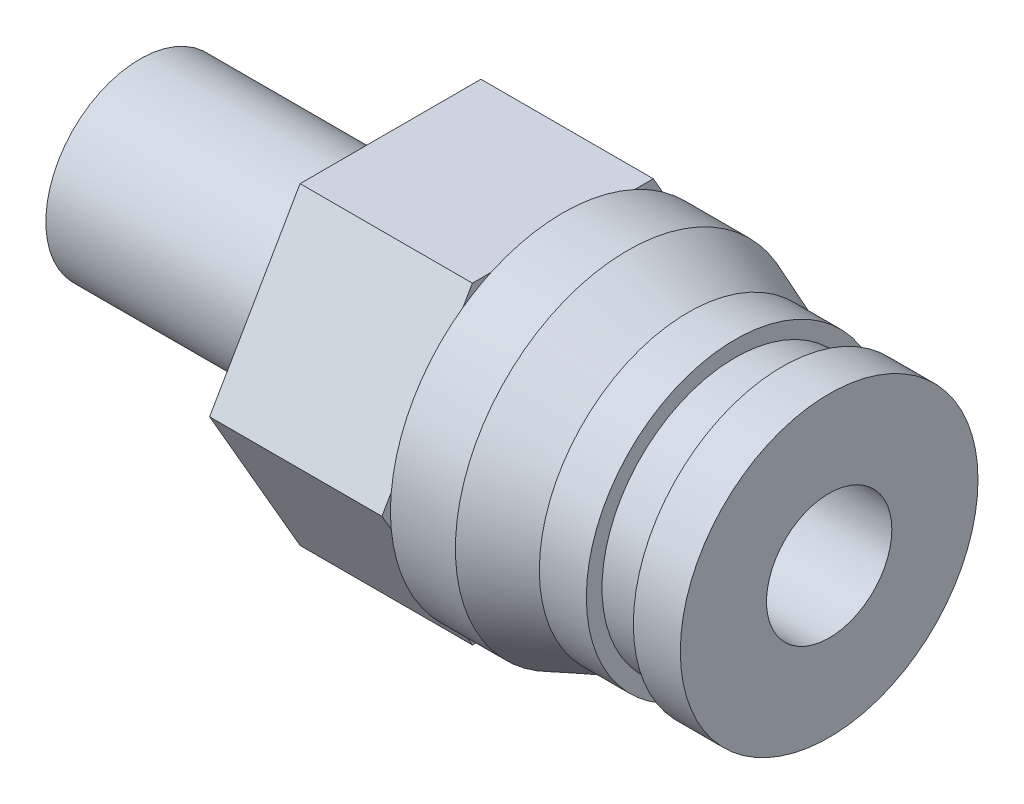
ISO-10303-21;
HEADER;
FILE_DESCRIPTION(('STEP AP214'),'2;1');
FILE_NAME('part.step','',(''),(''),'','','');
FILE_SCHEMA(('AUTOMOTIVE_DESIGN { 1 0 10303 214 1 1 1 1 }'));
ENDSEC;
DATA;
#1=APPLICATION_CONTEXT('core data for automotive mechanical design processes');
#2=APPLICATION_PROTOCOL_DEFINITION('international standard','automotive_design',2000,#1);
#3=PRODUCT_CONTEXT('',#1,'mechanical');
#4=PRODUCT('Part','Part','',(#3));
#5=PRODUCT_RELATED_PRODUCT_CATEGORY('part','',(#4));
#6=PRODUCT_DEFINITION_FORMATION('','',#4);
#7=PRODUCT_DEFINITION_CONTEXT('part definition',#1,'design');
#8=PRODUCT_DEFINITION('design','',#6,#7);
#9=PRODUCT_DEFINITION_SHAPE('','',#8);
#10=(LENGTH_UNIT() NAMED_UNIT(*) SI_UNIT(.MILLI.,.METRE.));
#11=(NAMED_UNIT(*) PLANE_ANGLE_UNIT() SI_UNIT($,.RADIAN.));
#12=(NAMED_UNIT(*) SI_UNIT($,.STERADIAN.) SOLID_ANGLE_UNIT());
#13=UNCERTAINTY_MEASURE_WITH_UNIT(LENGTH_MEASURE(1.E-05),#10,'distance_accuracy_value','');
#14=(GEOMETRIC_REPRESENTATION_CONTEXT(3) GLOBAL_UNCERTAINTY_ASSIGNED_CONTEXT((#13)) GLOBAL_UNIT_ASSIGNED_CONTEXT((#10,
#11,#12)) REPRESENTATION_CONTEXT('',''));
#15=CARTESIAN_POINT('',(0.,0.,0.));
#16=DIRECTION('',(0.,0.,1.));
#17=DIRECTION('',(1.,0.,0.));
#18=AXIS2_PLACEMENT_3D('',#15,#16,#17);
#19=CARTESIAN_POINT('',(8.,3.,0.));
#20=DIRECTION('',(-1.,0.,0.));
#21=DIRECTION('',(0.,0.,1.));
#22=AXIS2_PLACEMENT_3D('',#19,#20,#21);
#23=PLANE('',#22);
#24=CARTESIAN_POINT('',(8.,0.,0.));
#25=DIRECTION('',(1.,0.,0.));
#26=DIRECTION('',(0.,0.,-1.));
#27=AXIS2_PLACEMENT_3D('',#24,#25,#26);
#28=CIRCLE('',#27,3.);
#29=CARTESIAN_POINT('',(8.,0.,-3.));
#30=VERTEX_POINT('',#29);
#31=EDGE_CURVE('E270',#30,#30,#28,.T.);
#32=ORIENTED_EDGE('',*,*,#31,.T.);
#33=EDGE_LOOP('',(#32));
#34=FACE_BOUND('',#33,.T.);
#35=DIRECTION('',(0.,-0.866025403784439,0.5));
#36=VECTOR('',#35,1.);
#37=CARTESIAN_POINT('',(8.,0.,-5.77350269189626));
#38=LINE('',#37,#36);
#39=CARTESIAN_POINT('',(8.,0.,-5.77350269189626));
#40=VERTEX_POINT('',#39);
#41=CARTESIAN_POINT('',(8.,-5.,-2.88675134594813));
#42=VERTEX_POINT('',#41);
#43=EDGE_CURVE('E164',#40,#42,#38,.T.);
#44=ORIENTED_EDGE('',*,*,#43,.T.);
#45=DIRECTION('',(0.,0.,1.));
#46=VECTOR('',#45,1.);
#47=CARTESIAN_POINT('',(8.,-5.,-2.88675134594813));
#48=LINE('',#47,#46);
#49=CARTESIAN_POINT('',(8.,-5.,2.88675134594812));
#50=VERTEX_POINT('',#49);
#51=EDGE_CURVE('E146',#42,#50,#48,.T.);
#52=ORIENTED_EDGE('',*,*,#51,.T.);
#53=DIRECTION('',(0.,0.866025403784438,0.5));
#54=VECTOR('',#53,1.);
#55=CARTESIAN_POINT('',(8.,-5.,2.88675134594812));
#56=LINE('',#55,#54);
#57=CARTESIAN_POINT('',(8.,0.,5.77350269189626));
#58=VERTEX_POINT('',#57);
#59=EDGE_CURVE('E158',#50,#58,#56,.T.);
#60=ORIENTED_EDGE('',*,*,#59,.T.);
#61=DIRECTION('',(0.,0.866025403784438,-0.5));
#62=VECTOR('',#61,1.);
#63=CARTESIAN_POINT('',(8.,0.,5.77350269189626));
#64=LINE('',#63,#62);
#65=CARTESIAN_POINT('',(8.,5.,2.88675134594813));
#66=VERTEX_POINT('',#65);
#67=EDGE_CURVE('E30',#58,#66,#64,.T.);
#68=ORIENTED_EDGE('',*,*,#67,.T.);
#69=DIRECTION('',(0.,0.,-1.));
#70=VECTOR('',#69,1.);
#71=CARTESIAN_POINT('',(8.,5.,2.88675134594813));
#72=LINE('',#71,#70);
#73=CARTESIAN_POINT('',(8.,5.,-2.88675134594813));
#74=VERTEX_POINT('',#73);
#75=EDGE_CURVE('E168',#66,#74,#72,.T.);
#76=ORIENTED_EDGE('',*,*,#75,.T.);
#77=DIRECTION('',(0.,-0.866025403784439,-0.5));
#78=VECTOR('',#77,1.);
#79=CARTESIAN_POINT('',(8.,5.,-2.88675134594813));
#80=LINE('',#79,#78);
#81=EDGE_CURVE('E171',#74,#40,#80,.T.);
#82=ORIENTED_EDGE('',*,*,#81,.T.);
#83=EDGE_LOOP('',(#44,#52,#60,#68,#76,#82));
#84=FACE_BOUND('',#83,.T.);
#85=ADVANCED_FACE('F15',(#34,#84),#23,.T.);
#86=CARTESIAN_POINT('',(13.5,7.,0.));
#87=DIRECTION('',(1.,0.,0.));
#88=DIRECTION('',(0.,0.,-1.));
#89=AXIS2_PLACEMENT_3D('',#86,#87,#88);
#90=PLANE('',#89);
#91=CARTESIAN_POINT('',(13.5,0.,0.));
#92=DIRECTION('',(1.,0.,0.));
#93=DIRECTION('',(0.,0.,-1.));
#94=AXIS2_PLACEMENT_3D('',#91,#92,#93);
#95=CIRCLE('',#94,5.49960260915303);
#96=CARTESIAN_POINT('',(13.5,-5.,-2.29033378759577));
#97=VERTEX_POINT('',#96);
#98=CARTESIAN_POINT('',(13.5,-4.48348724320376,-3.18496012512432));
#99=VERTEX_POINT('',#98);
#100=EDGE_CURVE('E381',#97,#99,#95,.T.);
#101=ORIENTED_EDGE('',*,*,#100,.F.);
#102=DIRECTION('',(0.,0.,1.));
#103=VECTOR('',#102,1.);
#104=CARTESIAN_POINT('',(13.5,-5.,-2.88675134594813));
#105=LINE('',#104,#103);
#106=CARTESIAN_POINT('',(13.5,-5.,-2.88675134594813));
#107=VERTEX_POINT('',#106);
#108=EDGE_CURVE('E174',#107,#97,#105,.T.);
#109=ORIENTED_EDGE('',*,*,#108,.F.);
#110=DIRECTION('',(0.,-0.866025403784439,0.5));
#111=VECTOR('',#110,1.);
#112=CARTESIAN_POINT('',(13.5,0.,-5.77350269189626));
#113=LINE('',#112,#111);
#114=EDGE_CURVE('E194',#99,#107,#113,.T.);
#115=ORIENTED_EDGE('',*,*,#114,.F.);
#116=EDGE_LOOP('',(#101,#109,#115));
#117=FACE_BOUND('',#116,.T.);
#118=ADVANCED_FACE('F325',(#117),#90,.T.);
#119=CARTESIAN_POINT('',(13.5,-0.516512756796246,-5.47529391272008));
#120=VERTEX_POINT('',#119);
#121=CARTESIAN_POINT('',(13.5,0.516512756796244,-5.47529391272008));
#122=VERTEX_POINT('',#121);
#123=EDGE_CURVE('E266',#120,#122,#95,.T.);
#124=ORIENTED_EDGE('',*,*,#123,.F.);
#125=CARTESIAN_POINT('',(13.5,0.,-5.77350269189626));
#126=VERTEX_POINT('',#125);
#127=EDGE_CURVE('E155',#126,#120,#113,.T.);
#128=ORIENTED_EDGE('',*,*,#127,.F.);
#129=DIRECTION('',(0.,-0.866025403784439,-0.5));
#130=VECTOR('',#129,1.);
#131=CARTESIAN_POINT('',(13.5,5.,-2.88675134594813));
#132=LINE('',#131,#130);
#133=EDGE_CURVE('E189',#122,#126,#132,.T.);
#134=ORIENTED_EDGE('',*,*,#133,.F.);
#135=EDGE_LOOP('',(#124,#128,#134));
#136=FACE_BOUND('',#135,.T.);
#137=ADVANCED_FACE('F331',(#136),#90,.T.);
#138=CARTESIAN_POINT('',(13.5,4.48348724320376,-3.18496012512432));
#139=VERTEX_POINT('',#138);
#140=CARTESIAN_POINT('',(13.5,5.,-2.29033378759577));
#141=VERTEX_POINT('',#140);
#142=EDGE_CURVE('E271',#139,#141,#95,.T.);
#143=ORIENTED_EDGE('',*,*,#142,.F.);
#144=CARTESIAN_POINT('',(13.5,5.,-2.88675134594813));
#145=VERTEX_POINT('',#144);
#146=EDGE_CURVE('E191',#145,#139,#132,.T.);
#147=ORIENTED_EDGE('',*,*,#146,.F.);
#148=DIRECTION('',(0.,0.,-1.));
#149=VECTOR('',#148,1.);
#150=CARTESIAN_POINT('',(13.5,5.,2.88675134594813));
#151=LINE('',#150,#149);
#152=EDGE_CURVE('E184',#141,#145,#151,.T.);
#153=ORIENTED_EDGE('',*,*,#152,.F.);
#154=EDGE_LOOP('',(#143,#147,#153));
#155=FACE_BOUND('',#154,.T.);
#156=ADVANCED_FACE('F443',(#155),#90,.T.);
#157=CARTESIAN_POINT('',(13.5,5.,2.29033378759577));
#158=VERTEX_POINT('',#157);
#159=CARTESIAN_POINT('',(13.5,4.48348724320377,3.18496012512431));
#160=VERTEX_POINT('',#159);
#161=EDGE_CURVE('E378',#158,#160,#95,.T.);
#162=ORIENTED_EDGE('',*,*,#161,.F.);
#163=CARTESIAN_POINT('',(13.5,5.,2.88675134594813));
#164=VERTEX_POINT('',#163);
#165=EDGE_CURVE('E186',#164,#158,#151,.T.);
#166=ORIENTED_EDGE('',*,*,#165,.F.);
#167=DIRECTION('',(0.,0.866025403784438,-0.5));
#168=VECTOR('',#167,1.);
#169=CARTESIAN_POINT('',(13.5,0.,5.77350269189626));
#170=LINE('',#169,#168);
#171=EDGE_CURVE('E181',#160,#164,#170,.T.);
#172=ORIENTED_EDGE('',*,*,#171,.F.);
#173=EDGE_LOOP('',(#162,#166,#172));
#174=FACE_BOUND('',#173,.T.);
#175=ADVANCED_FACE('F361',(#174),#90,.T.);
#176=CARTESIAN_POINT('',(13.5,0.516512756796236,5.47529391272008));
#177=VERTEX_POINT('',#176);
#178=CARTESIAN_POINT('',(13.5,-0.516512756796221,5.47529391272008));
#179=VERTEX_POINT('',#178);
#180=EDGE_CURVE('E372',#177,#179,#95,.T.);
#181=ORIENTED_EDGE('',*,*,#180,.F.);
#182=CARTESIAN_POINT('',(13.5,0.,5.77350269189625));
#183=VERTEX_POINT('',#182);
#184=EDGE_CURVE('E36',#183,#177,#170,.T.);
#185=ORIENTED_EDGE('',*,*,#184,.F.);
#186=DIRECTION('',(0.,0.866025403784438,0.5));
#187=VECTOR('',#186,1.);
#188=CARTESIAN_POINT('',(13.5,-5.,2.88675134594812));
#189=LINE('',#188,#187);
#190=EDGE_CURVE('E177',#179,#183,#189,.T.);
#191=ORIENTED_EDGE('',*,*,#190,.F.);
#192=EDGE_LOOP('',(#181,#185,#191));
#193=FACE_BOUND('',#192,.T.);
#194=ADVANCED_FACE('F356',(#193),#90,.T.);
#195=CARTESIAN_POINT('',(13.5,-5.,2.88675134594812));
#196=VERTEX_POINT('',#195);
#197=CARTESIAN_POINT('',(13.5,-4.48348724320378,3.1849601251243));
#198=VERTEX_POINT('',#197);
#199=EDGE_CURVE('E179',#196,#198,#189,.T.);
#200=ORIENTED_EDGE('',*,*,#199,.F.);
#201=CARTESIAN_POINT('',(13.5,-5.,2.29033378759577));
#202=VERTEX_POINT('',#201);
#203=EDGE_CURVE('E150',#202,#196,#105,.T.);
#204=ORIENTED_EDGE('',*,*,#203,.F.);
#205=EDGE_CURVE('E365',#198,#202,#95,.T.);
#206=ORIENTED_EDGE('',*,*,#205,.F.);
#207=EDGE_LOOP('',(#200,#204,#206));
#208=FACE_BOUND('',#207,.T.);
#209=ADVANCED_FACE('F334',(#208),#90,.T.);
#210=CARTESIAN_POINT('',(0.,0.,0.));
#211=DIRECTION('',(-1.,0.,0.));
#212=DIRECTION('',(0.,0.,1.));
#213=AXIS2_PLACEMENT_3D('',#210,#211,#212);
#214=PLANE('',#213);
#215=CARTESIAN_POINT('',(0.,0.,0.));
#216=DIRECTION('',(1.,0.,0.));
#217=DIRECTION('',(0.,0.,-1.));
#218=AXIS2_PLACEMENT_3D('',#215,#216,#217);
#219=CIRCLE('',#218,3.);
#220=CARTESIAN_POINT('',(0.,0.,-3.));
#221=VERTEX_POINT('',#220);
#222=EDGE_CURVE('E274',#221,#221,#219,.T.);
#223=ORIENTED_EDGE('',*,*,#222,.F.);
#224=EDGE_LOOP('',(#223));
#225=FACE_BOUND('',#224,.T.);
#226=DIRECTION('',(0.,-0.866025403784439,-0.5));
#227=VECTOR('',#226,1.);
#228=CARTESIAN_POINT('',(0.,0.,1.15470053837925));
#229=LINE('',#228,#227);
#230=CARTESIAN_POINT('',(0.,0.,1.15470053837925));
#231=VERTEX_POINT('',#230);
#232=CARTESIAN_POINT('',(0.,-1.,0.577350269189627));
#233=VERTEX_POINT('',#232);
#234=EDGE_CURVE('E223',#231,#233,#229,.T.);
#235=ORIENTED_EDGE('',*,*,#234,.T.);
#236=DIRECTION('',(0.,0.,-1.));
#237=VECTOR('',#236,1.);
#238=CARTESIAN_POINT('',(0.,-1.,0.577350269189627));
#239=LINE('',#238,#237);
#240=CARTESIAN_POINT('',(0.,-1.,-0.577350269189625));
#241=VERTEX_POINT('',#240);
#242=EDGE_CURVE('E201',#233,#241,#239,.T.);
#243=ORIENTED_EDGE('',*,*,#242,.T.);
#244=DIRECTION('',(0.,0.866025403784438,-0.5));
#245=VECTOR('',#244,1.);
#246=CARTESIAN_POINT('',(0.,-1.,-0.577350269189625));
#247=LINE('',#246,#245);
#248=CARTESIAN_POINT('',(0.,0.,-1.15470053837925));
#249=VERTEX_POINT('',#248);
#250=EDGE_CURVE('E211',#241,#249,#247,.T.);
#251=ORIENTED_EDGE('',*,*,#250,.T.);
#252=DIRECTION('',(0.,0.866025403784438,0.5));
#253=VECTOR('',#252,1.);
#254=CARTESIAN_POINT('',(0.,0.,-1.15470053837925));
#255=LINE('',#254,#253);
#256=CARTESIAN_POINT('',(0.,1.,-0.577350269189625));
#257=VERTEX_POINT('',#256);
#258=EDGE_CURVE('E214',#249,#257,#255,.T.);
#259=ORIENTED_EDGE('',*,*,#258,.T.);
#260=DIRECTION('',(0.,0.,1.));
#261=VECTOR('',#260,1.);
#262=CARTESIAN_POINT('',(0.,1.,-0.577350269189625));
#263=LINE('',#262,#261);
#264=CARTESIAN_POINT('',(0.,1.,0.577350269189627));
#265=VERTEX_POINT('',#264);
#266=EDGE_CURVE('E217',#257,#265,#263,.T.);
#267=ORIENTED_EDGE('',*,*,#266,.T.);
#268=DIRECTION('',(0.,-0.866025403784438,0.5));
#269=VECTOR('',#268,1.);
#270=CARTESIAN_POINT('',(0.,1.,0.577350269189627));
#271=LINE('',#270,#269);
#272=EDGE_CURVE('E220',#265,#231,#271,.T.);
#273=ORIENTED_EDGE('',*,*,#272,.T.);
#274=EDGE_LOOP('',(#235,#243,#251,#259,#267,#273));
#275=FACE_BOUND('',#274,.T.);
#276=ADVANCED_FACE('F17',(#225,#275),#214,.T.);
#277=CARTESIAN_POINT('',(5.99999999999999,2.,0.));
#278=DIRECTION('',(1.,0.,0.));
#279=DIRECTION('',(0.,0.,-1.));
#280=AXIS2_PLACEMENT_3D('',#277,#278,#279);
#281=PLANE('',#280);
#282=CARTESIAN_POINT('',(5.99999999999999,0.,0.));
#283=DIRECTION('',(1.,0.,0.));
#284=DIRECTION('',(0.,0.,-1.));
#285=AXIS2_PLACEMENT_3D('',#282,#283,#284);
#286=CIRCLE('',#285,2.);
#287=CARTESIAN_POINT('',(5.99999999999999,0.,-2.));
#288=VERTEX_POINT('',#287);
#289=EDGE_CURVE('E239',#288,#288,#286,.T.);
#290=ORIENTED_EDGE('',*,*,#289,.T.);
#291=EDGE_LOOP('',(#290));
#292=FACE_BOUND('',#291,.T.);
#293=DIRECTION('',(0.,-0.866025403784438,0.5));
#294=VECTOR('',#293,1.);
#295=CARTESIAN_POINT('',(5.99999999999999,1.,-1.73205080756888));
#296=LINE('',#295,#294);
#297=CARTESIAN_POINT('',(5.99999999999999,0.,-1.15470053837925));
#298=VERTEX_POINT('',#297);
#299=CARTESIAN_POINT('',(5.99999999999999,-1.,-0.577350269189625));
#300=VERTEX_POINT('',#299);
#301=EDGE_CURVE('E23',#298,#300,#296,.T.);
#302=ORIENTED_EDGE('',*,*,#301,.T.);
#303=DIRECTION('',(0.,0.,1.));
#304=VECTOR('',#303,1.);
#305=CARTESIAN_POINT('',(5.99999999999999,-1.,0.));
#306=LINE('',#305,#304);
#307=CARTESIAN_POINT('',(5.99999999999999,-1.,0.577350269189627));
#308=VERTEX_POINT('',#307);
#309=EDGE_CURVE('E9',#300,#308,#306,.T.);
#310=ORIENTED_EDGE('',*,*,#309,.T.);
#311=DIRECTION('',(0.,0.866025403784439,0.5));
#312=VECTOR('',#311,1.);
#313=CARTESIAN_POINT('',(5.99999999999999,1.,1.73205080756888));
#314=LINE('',#313,#312);
#315=CARTESIAN_POINT('',(5.99999999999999,0.,1.15470053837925));
#316=VERTEX_POINT('',#315);
#317=EDGE_CURVE('E277',#308,#316,#314,.T.);
#318=ORIENTED_EDGE('',*,*,#317,.T.);
#319=DIRECTION('',(0.,0.866025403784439,-0.5));
#320=VECTOR('',#319,1.);
#321=CARTESIAN_POINT('',(5.99999999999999,2.,0.));
#322=LINE('',#321,#320);
#323=CARTESIAN_POINT('',(5.99999999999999,1.,0.577350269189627));
#324=VERTEX_POINT('',#323);
#325=EDGE_CURVE('E280',#316,#324,#322,.T.);
#326=ORIENTED_EDGE('',*,*,#325,.T.);
#327=DIRECTION('',(0.,0.,-1.));
#328=VECTOR('',#327,1.);
#329=CARTESIAN_POINT('',(5.99999999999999,1.,0.));
#330=LINE('',#329,#328);
#331=CARTESIAN_POINT('',(5.99999999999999,1.,-0.577350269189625));
#332=VERTEX_POINT('',#331);
#333=EDGE_CURVE('E283',#324,#332,#330,.T.);
#334=ORIENTED_EDGE('',*,*,#333,.T.);
#335=DIRECTION('',(0.,-0.866025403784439,-0.5));
#336=VECTOR('',#335,1.);
#337=CARTESIAN_POINT('',(5.99999999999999,2.,0.));
#338=LINE('',#337,#336);
#339=EDGE_CURVE('E286',#332,#298,#338,.T.);
#340=ORIENTED_EDGE('',*,*,#339,.T.);
#341=EDGE_LOOP('',(#302,#310,#318,#326,#334,#340));
#342=FACE_BOUND('',#341,.T.);
#343=ADVANCED_FACE('F290',(#292,#342),#281,.T.);
#344=CARTESIAN_POINT('',(0.,0.,0.));
#345=DIRECTION('',(1.,0.,0.));
#346=DIRECTION('',(0.,0.,-1.));
#347=AXIS2_PLACEMENT_3D('',#344,#345,#346);
#348=CYLINDRICAL_SURFACE('',#347,3.);
#349=ORIENTED_EDGE('',*,*,#222,.T.);
#350=EDGE_LOOP('',(#349));
#351=FACE_BOUND('',#350,.T.);
#352=ORIENTED_EDGE('',*,*,#31,.F.);
#353=EDGE_LOOP('',(#352));
#354=FACE_BOUND('',#353,.T.);
#355=ADVANCED_FACE('F336',(#351,#354),#348,.T.);
#356=CARTESIAN_POINT('',(0.,0.,0.));
#357=DIRECTION('',(1.,0.,0.));
#358=DIRECTION('',(0.,0.,-1.));
#359=AXIS2_PLACEMENT_3D('',#356,#357,#358);
#360=CYLINDRICAL_SURFACE('',#359,5.49960260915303);
#361=EDGE_CURVE('E267',#122,#139,#95,.T.);
#362=ORIENTED_EDGE('',*,*,#361,.T.);
#363=ORIENTED_EDGE('',*,*,#142,.T.);
#364=EDGE_CURVE('E445',#141,#158,#95,.T.);
#365=ORIENTED_EDGE('',*,*,#364,.T.);
#366=ORIENTED_EDGE('',*,*,#161,.T.);
#367=EDGE_CURVE('E377',#160,#177,#95,.T.);
#368=ORIENTED_EDGE('',*,*,#367,.T.);
#369=ORIENTED_EDGE('',*,*,#180,.T.);
#370=EDGE_CURVE('E375',#179,#198,#95,.T.);
#371=ORIENTED_EDGE('',*,*,#370,.T.);
#372=ORIENTED_EDGE('',*,*,#205,.T.);
#373=EDGE_CURVE('E379',#202,#97,#95,.T.);
#374=ORIENTED_EDGE('',*,*,#373,.T.);
#375=ORIENTED_EDGE('',*,*,#100,.T.);
#376=EDGE_CURVE('E383',#99,#120,#95,.T.);
#377=ORIENTED_EDGE('',*,*,#376,.T.);
#378=ORIENTED_EDGE('',*,*,#123,.T.);
#379=EDGE_LOOP('',(#362,#363,#365,#366,#368,#369,#371,#372,#374,#375,#377,#378));
#380=FACE_BOUND('',#379,.T.);
#381=CARTESIAN_POINT('',(15.5702380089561,0.,0.));
#382=DIRECTION('',(1.,0.,0.));
#383=DIRECTION('',(0.,0.,-1.));
#384=AXIS2_PLACEMENT_3D('',#381,#382,#383);
#385=CIRCLE('',#384,5.49960260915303);
#386=CARTESIAN_POINT('',(15.5702380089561,0.,-5.49960260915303));
#387=VERTEX_POINT('',#386);
#388=EDGE_CURVE('E263',#387,#387,#385,.T.);
#389=ORIENTED_EDGE('',*,*,#388,.F.);
#390=EDGE_LOOP('',(#389));
#391=FACE_BOUND('',#390,.T.);
#392=ADVANCED_FACE('F338',(#380,#391),#360,.T.);
#393=CARTESIAN_POINT('',(17.5,0.,0.));
#394=DIRECTION('',(-1.,0.,0.));
#395=DIRECTION('',(0.,0.,1.));
#396=AXIS2_PLACEMENT_3D('',#393,#394,#395);
#397=CONICAL_SURFACE('',#396,4.75,0.370503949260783);
#398=ORIENTED_EDGE('',*,*,#388,.T.);
#399=EDGE_LOOP('',(#398));
#400=FACE_BOUND('',#399,.T.);
#401=CARTESIAN_POINT('',(17.5,0.,0.));
#402=DIRECTION('',(1.,0.,0.));
#403=DIRECTION('',(0.,0.,-1.));
#404=AXIS2_PLACEMENT_3D('',#401,#402,#403);
#405=CIRCLE('',#404,4.75);
#406=CARTESIAN_POINT('',(17.5,0.,-4.75));
#407=VERTEX_POINT('',#406);
#408=EDGE_CURVE('E260',#407,#407,#405,.T.);
#409=ORIENTED_EDGE('',*,*,#408,.F.);
#410=EDGE_LOOP('',(#409));
#411=FACE_BOUND('',#410,.T.);
#412=ADVANCED_FACE('F344',(#400,#411),#397,.T.);
#413=CARTESIAN_POINT('',(0.,0.,0.));
#414=DIRECTION('',(1.,0.,0.));
#415=DIRECTION('',(0.,0.,-1.));
#416=AXIS2_PLACEMENT_3D('',#413,#414,#415);
#417=CYLINDRICAL_SURFACE('',#416,4.75);
#418=ORIENTED_EDGE('',*,*,#408,.T.);
#419=EDGE_LOOP('',(#418));
#420=FACE_BOUND('',#419,.T.);
#421=CARTESIAN_POINT('',(19.,0.,0.));
#422=DIRECTION('',(1.,0.,0.));
#423=DIRECTION('',(0.,0.,-1.));
#424=AXIS2_PLACEMENT_3D('',#421,#422,#423);
#425=CIRCLE('',#424,4.75);
#426=CARTESIAN_POINT('',(19.,0.,-4.75));
#427=VERTEX_POINT('',#426);
#428=EDGE_CURVE('E257',#427,#427,#425,.T.);
#429=ORIENTED_EDGE('',*,*,#428,.F.);
#430=EDGE_LOOP('',(#429));
#431=FACE_BOUND('',#430,.T.);
#432=ADVANCED_FACE('F606',(#420,#431),#417,.T.);
#433=CARTESIAN_POINT('',(19.,4.75,0.));
#434=DIRECTION('',(1.,0.,0.));
#435=DIRECTION('',(0.,0.,-1.));
#436=AXIS2_PLACEMENT_3D('',#433,#434,#435);
#437=PLANE('',#436);
#438=ORIENTED_EDGE('',*,*,#428,.T.);
#439=EDGE_LOOP('',(#438));
#440=FACE_BOUND('',#439,.T.);
#441=CARTESIAN_POINT('',(19.,0.,0.));
#442=DIRECTION('',(1.,0.,0.));
#443=DIRECTION('',(0.,0.,-1.));
#444=AXIS2_PLACEMENT_3D('',#441,#442,#443);
#445=CIRCLE('',#444,4.25);
#446=CARTESIAN_POINT('',(19.,0.,-4.25));
#447=VERTEX_POINT('',#446);
#448=EDGE_CURVE('E254',#447,#447,#445,.T.);
#449=ORIENTED_EDGE('',*,*,#448,.F.);
#450=EDGE_LOOP('',(#449));
#451=FACE_BOUND('',#450,.T.);
#452=ADVANCED_FACE('F596',(#440,#451),#437,.T.);
#453=CARTESIAN_POINT('',(0.,0.,0.));
#454=DIRECTION('',(1.,0.,0.));
#455=DIRECTION('',(0.,0.,-1.));
#456=AXIS2_PLACEMENT_3D('',#453,#454,#455);
#457=CYLINDRICAL_SURFACE('',#456,4.25);
#458=ORIENTED_EDGE('',*,*,#448,.T.);
#459=EDGE_LOOP('',(#458));
#460=FACE_BOUND('',#459,.T.);
#461=CARTESIAN_POINT('',(20.5,0.,0.));
#462=DIRECTION('',(1.,0.,0.));
#463=DIRECTION('',(0.,0.,-1.));
#464=AXIS2_PLACEMENT_3D('',#461,#462,#463);
#465=CIRCLE('',#464,4.25);
#466=CARTESIAN_POINT('',(20.5,0.,-4.25));
#467=VERTEX_POINT('',#466);
#468=EDGE_CURVE('E251',#467,#467,#465,.T.);
#469=ORIENTED_EDGE('',*,*,#468,.F.);
#470=EDGE_LOOP('',(#469));
#471=FACE_BOUND('',#470,.T.);
#472=ADVANCED_FACE('F586',(#460,#471),#457,.T.);
#473=CARTESIAN_POINT('',(20.5,4.25,0.));
#474=DIRECTION('',(-1.,0.,0.));
#475=DIRECTION('',(0.,0.,1.));
#476=AXIS2_PLACEMENT_3D('',#473,#474,#475);
#477=PLANE('',#476);
#478=ORIENTED_EDGE('',*,*,#468,.T.);
#479=EDGE_LOOP('',(#478));
#480=FACE_BOUND('',#479,.T.);
#481=CARTESIAN_POINT('',(20.5,0.,0.));
#482=DIRECTION('',(1.,0.,0.));
#483=DIRECTION('',(0.,0.,-1.));
#484=AXIS2_PLACEMENT_3D('',#481,#482,#483);
#485=CIRCLE('',#484,4.75);
#486=CARTESIAN_POINT('',(20.5,0.,-4.75));
#487=VERTEX_POINT('',#486);
#488=EDGE_CURVE('E248',#487,#487,#485,.T.);
#489=ORIENTED_EDGE('',*,*,#488,.F.);
#490=EDGE_LOOP('',(#489));
#491=FACE_BOUND('',#490,.T.);
#492=ADVANCED_FACE('F575',(#480,#491),#477,.T.);
#493=CARTESIAN_POINT('',(0.,0.,0.));
#494=DIRECTION('',(1.,0.,0.));
#495=DIRECTION('',(0.,0.,-1.));
#496=AXIS2_PLACEMENT_3D('',#493,#494,#495);
#497=CYLINDRICAL_SURFACE('',#496,4.75);
#498=ORIENTED_EDGE('',*,*,#488,.T.);
#499=EDGE_LOOP('',(#498));
#500=FACE_BOUND('',#499,.T.);
#501=CARTESIAN_POINT('',(22.,0.,0.));
#502=DIRECTION('',(1.,0.,0.));
#503=DIRECTION('',(0.,0.,-1.));
#504=AXIS2_PLACEMENT_3D('',#501,#502,#503);
#505=CIRCLE('',#504,4.75);
#506=CARTESIAN_POINT('',(22.,0.,-4.75));
#507=VERTEX_POINT('',#506);
#508=EDGE_CURVE('E245',#507,#507,#505,.T.);
#509=ORIENTED_EDGE('',*,*,#508,.F.);
#510=EDGE_LOOP('',(#509));
#511=FACE_BOUND('',#510,.T.);
#512=ADVANCED_FACE('F565',(#500,#511),#497,.T.);
#513=CARTESIAN_POINT('',(22.,4.75,0.));
#514=DIRECTION('',(1.,0.,0.));
#515=DIRECTION('',(0.,0.,-1.));
#516=AXIS2_PLACEMENT_3D('',#513,#514,#515);
#517=PLANE('',#516);
#518=ORIENTED_EDGE('',*,*,#508,.T.);
#519=EDGE_LOOP('',(#518));
#520=FACE_BOUND('',#519,.T.);
#521=CARTESIAN_POINT('',(22.,0.,0.));
#522=DIRECTION('',(1.,0.,0.));
#523=DIRECTION('',(0.,0.,-1.));
#524=AXIS2_PLACEMENT_3D('',#521,#522,#523);
#525=CIRCLE('',#524,2.);
#526=CARTESIAN_POINT('',(22.,0.,-2.));
#527=VERTEX_POINT('',#526);
#528=EDGE_CURVE('E242',#527,#527,#525,.T.);
#529=ORIENTED_EDGE('',*,*,#528,.F.);
#530=EDGE_LOOP('',(#529));
#531=FACE_BOUND('',#530,.T.);
#532=ADVANCED_FACE('F551',(#520,#531),#517,.T.);
#533=CARTESIAN_POINT('',(0.,0.,0.));
#534=DIRECTION('',(1.,0.,0.));
#535=DIRECTION('',(0.,0.,-1.));
#536=AXIS2_PLACEMENT_3D('',#533,#534,#535);
#537=CYLINDRICAL_SURFACE('',#536,2.);
#538=ORIENTED_EDGE('',*,*,#528,.T.);
#539=EDGE_LOOP('',(#538));
#540=FACE_BOUND('',#539,.T.);
#541=ORIENTED_EDGE('',*,*,#289,.F.);
#542=EDGE_LOOP('',(#541));
#543=FACE_BOUND('',#542,.T.);
#544=ADVANCED_FACE('F541',(#540,#543),#537,.F.);
#545=CARTESIAN_POINT('',(22.,-1.,0.577350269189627));
#546=DIRECTION('',(0.,1.,0.));
#547=DIRECTION('',(0.,0.,1.));
#548=AXIS2_PLACEMENT_3D('',#545,#546,#547);
#549=PLANE('',#548);
#550=DIRECTION('',(-1.,0.,0.));
#551=VECTOR('',#550,1.);
#552=CARTESIAN_POINT('',(22.,-1.,-0.577350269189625));
#553=LINE('',#552,#551);
#554=EDGE_CURVE('E237',#300,#241,#553,.T.);
#555=ORIENTED_EDGE('',*,*,#554,.T.);
#556=ORIENTED_EDGE('',*,*,#242,.F.);
#557=DIRECTION('',(-1.,0.,0.));
#558=VECTOR('',#557,1.);
#559=CARTESIAN_POINT('',(22.,-1.,0.577350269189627));
#560=LINE('',#559,#558);
#561=EDGE_CURVE('E226',#308,#233,#560,.T.);
#562=ORIENTED_EDGE('',*,*,#561,.F.);
#563=ORIENTED_EDGE('',*,*,#309,.F.);
#564=EDGE_LOOP('',(#555,#556,#562,#563));
#565=FACE_BOUND('',#564,.T.);
#566=ADVANCED_FACE('F305',(#565),#549,.T.);
#567=CARTESIAN_POINT('',(22.,-1.,-0.577350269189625));
#568=DIRECTION('',(0.,0.5,0.866025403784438));
#569=DIRECTION('',(0.,-0.866025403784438,0.5));
#570=AXIS2_PLACEMENT_3D('',#567,#568,#569);
#571=PLANE('',#570);
#572=DIRECTION('',(-1.,0.,0.));
#573=VECTOR('',#572,1.);
#574=CARTESIAN_POINT('',(22.,0.,-1.15470053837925));
#575=LINE('',#574,#573);
#576=EDGE_CURVE('E235',#298,#249,#575,.T.);
#577=ORIENTED_EDGE('',*,*,#576,.T.);
#578=ORIENTED_EDGE('',*,*,#250,.F.);
#579=ORIENTED_EDGE('',*,*,#554,.F.);
#580=ORIENTED_EDGE('',*,*,#301,.F.);
#581=EDGE_LOOP('',(#577,#578,#579,#580));
#582=FACE_BOUND('',#581,.T.);
#583=ADVANCED_FACE('F294',(#582),#571,.T.);
#584=CARTESIAN_POINT('',(22.,0.,-1.15470053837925));
#585=DIRECTION('',(0.,-0.5,0.866025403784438));
#586=DIRECTION('',(0.,-0.866025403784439,-0.5));
#587=AXIS2_PLACEMENT_3D('',#584,#585,#586);
#588=PLANE('',#587);
#589=DIRECTION('',(-1.,0.,0.));
#590=VECTOR('',#589,1.);
#591=CARTESIAN_POINT('',(22.,1.,-0.577350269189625));
#592=LINE('',#591,#590);
#593=EDGE_CURVE('E233',#332,#257,#592,.T.);
#594=ORIENTED_EDGE('',*,*,#593,.T.);
#595=ORIENTED_EDGE('',*,*,#258,.F.);
#596=ORIENTED_EDGE('',*,*,#576,.F.);
#597=ORIENTED_EDGE('',*,*,#339,.F.);
#598=EDGE_LOOP('',(#594,#595,#596,#597));
#599=FACE_BOUND('',#598,.T.);
#600=ADVANCED_FACE('F298',(#599),#588,.T.);
#601=CARTESIAN_POINT('',(22.,1.,-0.577350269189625));
#602=DIRECTION('',(0.,-1.,0.));
#603=DIRECTION('',(0.,0.,-1.));
#604=AXIS2_PLACEMENT_3D('',#601,#602,#603);
#605=PLANE('',#604);
#606=DIRECTION('',(-1.,0.,0.));
#607=VECTOR('',#606,1.);
#608=CARTESIAN_POINT('',(22.,1.,0.577350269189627));
#609=LINE('',#608,#607);
#610=EDGE_CURVE('E231',#324,#265,#609,.T.);
#611=ORIENTED_EDGE('',*,*,#610,.T.);
#612=ORIENTED_EDGE('',*,*,#266,.F.);
#613=ORIENTED_EDGE('',*,*,#593,.F.);
#614=ORIENTED_EDGE('',*,*,#333,.F.);
#615=EDGE_LOOP('',(#611,#612,#613,#614));
#616=FACE_BOUND('',#615,.T.);
#617=ADVANCED_FACE('F314',(#616),#605,.T.);
#618=CARTESIAN_POINT('',(22.,1.,0.577350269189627));
#619=DIRECTION('',(0.,-0.5,-0.866025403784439));
#620=DIRECTION('',(0.,0.866025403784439,-0.5));
#621=AXIS2_PLACEMENT_3D('',#618,#619,#620);
#622=PLANE('',#621);
#623=DIRECTION('',(-1.,0.,0.));
#624=VECTOR('',#623,1.);
#625=CARTESIAN_POINT('',(22.,0.,1.15470053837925));
#626=LINE('',#625,#624);
#627=EDGE_CURVE('E229',#316,#231,#626,.T.);
#628=ORIENTED_EDGE('',*,*,#627,.T.);
#629=ORIENTED_EDGE('',*,*,#272,.F.);
#630=ORIENTED_EDGE('',*,*,#610,.F.);
#631=ORIENTED_EDGE('',*,*,#325,.F.);
#632=EDGE_LOOP('',(#628,#629,#630,#631));
#633=FACE_BOUND('',#632,.T.);
#634=ADVANCED_FACE('F311',(#633),#622,.T.);
#635=CARTESIAN_POINT('',(22.,0.,1.15470053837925));
#636=DIRECTION('',(0.,0.5,-0.866025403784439));
#637=DIRECTION('',(0.,0.866025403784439,0.5));
#638=AXIS2_PLACEMENT_3D('',#635,#636,#637);
#639=PLANE('',#638);
#640=ORIENTED_EDGE('',*,*,#561,.T.);
#641=ORIENTED_EDGE('',*,*,#234,.F.);
#642=ORIENTED_EDGE('',*,*,#627,.F.);
#643=ORIENTED_EDGE('',*,*,#317,.F.);
#644=EDGE_LOOP('',(#640,#641,#642,#643));
#645=FACE_BOUND('',#644,.T.);
#646=ADVANCED_FACE('F307',(#645),#639,.T.);
#647=CARTESIAN_POINT('',(13.5,0.,0.));
#648=DIRECTION('',(-1.,0.,0.));
#649=DIRECTION('',(0.,0.,1.));
#650=AXIS2_PLACEMENT_3D('',#647,#648,#649);
#651=PLANE('',#650);
#652=EDGE_CURVE('E182',#198,#179,#189,.T.);
#653=ORIENTED_EDGE('',*,*,#652,.F.);
#654=ORIENTED_EDGE('',*,*,#370,.F.);
#655=EDGE_LOOP('',(#653,#654));
#656=FACE_BOUND('',#655,.T.);
#657=ADVANCED_FACE('F417',(#656),#651,.T.);
#658=EDGE_CURVE('E178',#97,#202,#105,.T.);
#659=ORIENTED_EDGE('',*,*,#658,.F.);
#660=ORIENTED_EDGE('',*,*,#373,.F.);
#661=EDGE_LOOP('',(#659,#660));
#662=FACE_BOUND('',#661,.T.);
#663=ADVANCED_FACE('F411',(#662),#651,.T.);
#664=EDGE_CURVE('E198',#120,#99,#113,.T.);
#665=ORIENTED_EDGE('',*,*,#664,.F.);
#666=ORIENTED_EDGE('',*,*,#376,.F.);
#667=EDGE_LOOP('',(#665,#666));
#668=FACE_BOUND('',#667,.T.);
#669=ADVANCED_FACE('F403',(#668),#651,.T.);
#670=EDGE_CURVE('E195',#139,#122,#132,.T.);
#671=ORIENTED_EDGE('',*,*,#670,.F.);
#672=ORIENTED_EDGE('',*,*,#361,.F.);
#673=EDGE_LOOP('',(#671,#672));
#674=FACE_BOUND('',#673,.T.);
#675=ADVANCED_FACE('F400',(#674),#651,.T.);
#676=EDGE_CURVE('E190',#158,#141,#151,.T.);
#677=ORIENTED_EDGE('',*,*,#676,.F.);
#678=ORIENTED_EDGE('',*,*,#364,.F.);
#679=EDGE_LOOP('',(#677,#678));
#680=FACE_BOUND('',#679,.T.);
#681=ADVANCED_FACE('F402',(#680),#651,.T.);
#682=EDGE_CURVE('E185',#177,#160,#170,.T.);
#683=ORIENTED_EDGE('',*,*,#682,.F.);
#684=ORIENTED_EDGE('',*,*,#367,.F.);
#685=EDGE_LOOP('',(#683,#684));
#686=FACE_BOUND('',#685,.T.);
#687=ADVANCED_FACE('F409',(#686),#651,.T.);
#688=CARTESIAN_POINT('',(13.5,-5.,-2.88675134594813));
#689=DIRECTION('',(0.,-1.,0.));
#690=DIRECTION('',(0.,0.,-1.));
#691=AXIS2_PLACEMENT_3D('',#688,#689,#690);
#692=PLANE('',#691);
#693=DIRECTION('',(-1.,0.,0.));
#694=VECTOR('',#693,1.);
#695=CARTESIAN_POINT('',(13.5,-5.,-2.88675134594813));
#696=LINE('',#695,#694);
#697=EDGE_CURVE('E199',#107,#42,#696,.T.);
#698=ORIENTED_EDGE('',*,*,#697,.F.);
#699=ORIENTED_EDGE('',*,*,#108,.T.);
#700=ORIENTED_EDGE('',*,*,#658,.T.);
#701=ORIENTED_EDGE('',*,*,#203,.T.);
#702=DIRECTION('',(-1.,0.,0.));
#703=VECTOR('',#702,1.);
#704=CARTESIAN_POINT('',(13.5,-5.,2.88675134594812));
#705=LINE('',#704,#703);
#706=EDGE_CURVE('E141',#196,#50,#705,.T.);
#707=ORIENTED_EDGE('',*,*,#706,.T.);
#708=ORIENTED_EDGE('',*,*,#51,.F.);
#709=EDGE_LOOP('',(#698,#699,#700,#701,#707,#708));
#710=FACE_BOUND('',#709,.T.);
#711=ADVANCED_FACE('F144',(#710),#692,.T.);
#712=CARTESIAN_POINT('',(13.5,0.,-5.77350269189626));
#713=DIRECTION('',(0.,-0.5,-0.866025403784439));
#714=DIRECTION('',(0.,0.866025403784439,-0.5));
#715=AXIS2_PLACEMENT_3D('',#712,#713,#714);
#716=PLANE('',#715);
#717=DIRECTION('',(-1.,0.,0.));
#718=VECTOR('',#717,1.);
#719=CARTESIAN_POINT('',(13.5,0.,-5.77350269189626));
#720=LINE('',#719,#718);
#721=EDGE_CURVE('E202',#126,#40,#720,.T.);
#722=ORIENTED_EDGE('',*,*,#721,.F.);
#723=ORIENTED_EDGE('',*,*,#127,.T.);
#724=ORIENTED_EDGE('',*,*,#664,.T.);
#725=ORIENTED_EDGE('',*,*,#114,.T.);
#726=ORIENTED_EDGE('',*,*,#697,.T.);
#727=ORIENTED_EDGE('',*,*,#43,.F.);
#728=EDGE_LOOP('',(#722,#723,#724,#725,#726,#727));
#729=FACE_BOUND('',#728,.T.);
#730=ADVANCED_FACE('F433',(#729),#716,.T.);
#731=CARTESIAN_POINT('',(13.5,5.,-2.88675134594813));
#732=DIRECTION('',(0.,0.5,-0.866025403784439));
#733=DIRECTION('',(0.,0.866025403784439,0.5));
#734=AXIS2_PLACEMENT_3D('',#731,#732,#733);
#735=PLANE('',#734);
#736=DIRECTION('',(-1.,0.,0.));
#737=VECTOR('',#736,1.);
#738=CARTESIAN_POINT('',(13.5,5.,-2.88675134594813));
#739=LINE('',#738,#737);
#740=EDGE_CURVE('E204',#145,#74,#739,.T.);
#741=ORIENTED_EDGE('',*,*,#740,.F.);
#742=ORIENTED_EDGE('',*,*,#146,.T.);
#743=ORIENTED_EDGE('',*,*,#670,.T.);
#744=ORIENTED_EDGE('',*,*,#133,.T.);
#745=ORIENTED_EDGE('',*,*,#721,.T.);
#746=ORIENTED_EDGE('',*,*,#81,.F.);
#747=EDGE_LOOP('',(#741,#742,#743,#744,#745,#746));
#748=FACE_BOUND('',#747,.T.);
#749=ADVANCED_FACE('F396',(#748),#735,.T.);
#750=CARTESIAN_POINT('',(13.5,5.,2.88675134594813));
#751=DIRECTION('',(0.,1.,0.));
#752=DIRECTION('',(0.,0.,1.));
#753=AXIS2_PLACEMENT_3D('',#750,#751,#752);
#754=PLANE('',#753);
#755=DIRECTION('',(-1.,0.,0.));
#756=VECTOR('',#755,1.);
#757=CARTESIAN_POINT('',(13.5,5.,2.88675134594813));
#758=LINE('',#757,#756);
#759=EDGE_CURVE('E206',#164,#66,#758,.T.);
#760=ORIENTED_EDGE('',*,*,#759,.F.);
#761=ORIENTED_EDGE('',*,*,#165,.T.);
#762=ORIENTED_EDGE('',*,*,#676,.T.);
#763=ORIENTED_EDGE('',*,*,#152,.T.);
#764=ORIENTED_EDGE('',*,*,#740,.T.);
#765=ORIENTED_EDGE('',*,*,#75,.F.);
#766=EDGE_LOOP('',(#760,#761,#762,#763,#764,#765));
#767=FACE_BOUND('',#766,.T.);
#768=ADVANCED_FACE('F438',(#767),#754,.T.);
#769=CARTESIAN_POINT('',(13.5,0.,5.77350269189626));
#770=DIRECTION('',(0.,0.5,0.866025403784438));
#771=DIRECTION('',(0.,-0.866025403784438,0.5));
#772=AXIS2_PLACEMENT_3D('',#769,#770,#771);
#773=PLANE('',#772);
#774=DIRECTION('',(-1.,0.,0.));
#775=VECTOR('',#774,1.);
#776=CARTESIAN_POINT('',(13.5,0.,5.77350269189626));
#777=LINE('',#776,#775);
#778=EDGE_CURVE('E154',#183,#58,#777,.T.);
#779=ORIENTED_EDGE('',*,*,#778,.F.);
#780=ORIENTED_EDGE('',*,*,#184,.T.);
#781=ORIENTED_EDGE('',*,*,#682,.T.);
#782=ORIENTED_EDGE('',*,*,#171,.T.);
#783=ORIENTED_EDGE('',*,*,#759,.T.);
#784=ORIENTED_EDGE('',*,*,#67,.F.);
#785=EDGE_LOOP('',(#779,#780,#781,#782,#783,#784));
#786=FACE_BOUND('',#785,.T.);
#787=ADVANCED_FACE('F449',(#786),#773,.T.);
#788=CARTESIAN_POINT('',(13.5,-5.,2.88675134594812));
#789=DIRECTION('',(0.,-0.5,0.866025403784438));
#790=DIRECTION('',(0.,-0.866025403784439,-0.5));
#791=AXIS2_PLACEMENT_3D('',#788,#789,#790);
#792=PLANE('',#791);
#793=ORIENTED_EDGE('',*,*,#706,.F.);
#794=ORIENTED_EDGE('',*,*,#199,.T.);
#795=ORIENTED_EDGE('',*,*,#652,.T.);
#796=ORIENTED_EDGE('',*,*,#190,.T.);
#797=ORIENTED_EDGE('',*,*,#778,.T.);
#798=ORIENTED_EDGE('',*,*,#59,.F.);
#799=EDGE_LOOP('',(#793,#794,#795,#796,#797,#798));
#800=FACE_BOUND('',#799,.T.);
#801=ADVANCED_FACE('F159',(#800),#792,.T.);
#802=CLOSED_SHELL('',(#85,#118,#137,#156,#175,#194,#209,#276,#343,#355,#392,#412,#432,#452,#472,
#492,#512,#532,#544,#566,#583,#600,#617,#634,#646,#657,#663,#669,#675,#681,#687,#711,#730,#749,
#768,#787,#801));
#803=MANIFOLD_SOLID_BREP('B1',#802);
#804=ADVANCED_BREP_SHAPE_REPRESENTATION('',(#18,#803),#14);
#805=SHAPE_DEFINITION_REPRESENTATION(#9,#804);
ENDSEC;
END-ISO-10303-21;
